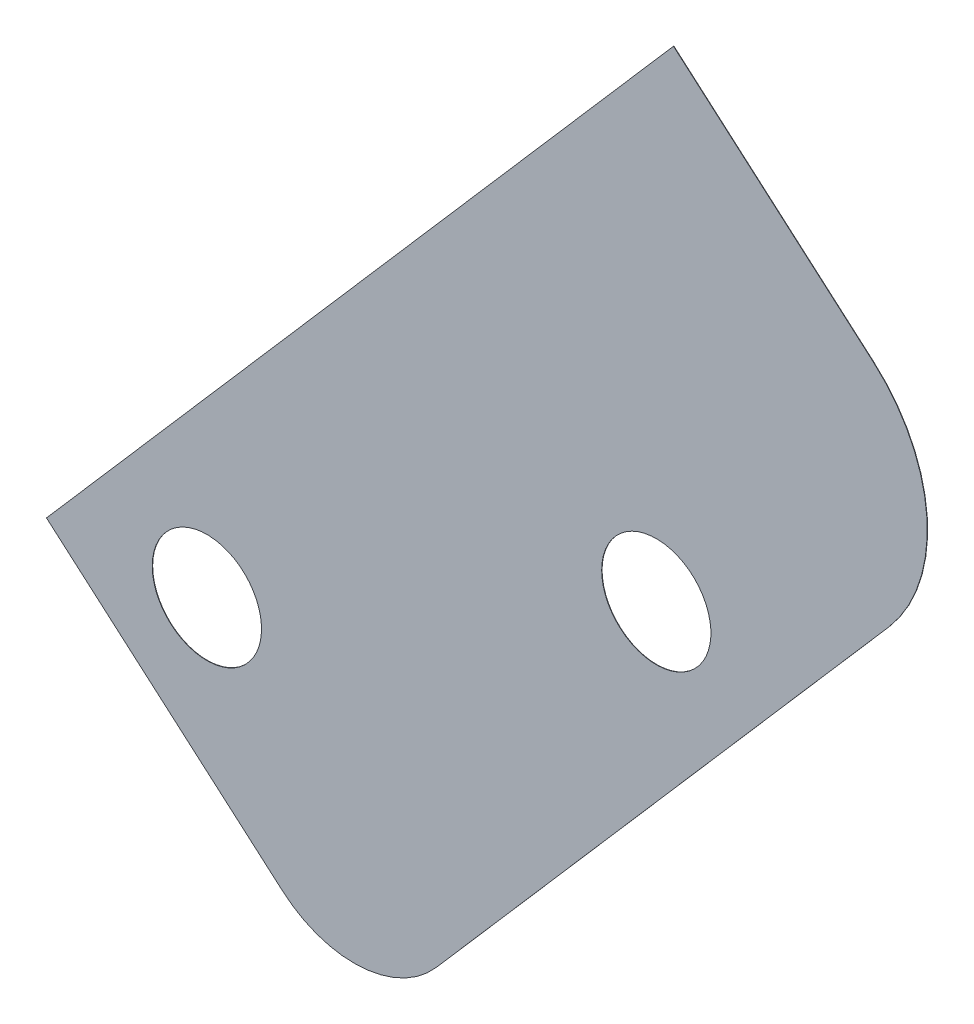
ISO-10303-21;
HEADER;
FILE_DESCRIPTION(('STEP AP214'),'2;1');
FILE_NAME('part.step','',(''),(''),'','','');
FILE_SCHEMA(('AUTOMOTIVE_DESIGN { 1 0 10303 214 1 1 1 1 }'));
ENDSEC;
DATA;
#1=APPLICATION_CONTEXT('core data for automotive mechanical design processes');
#2=APPLICATION_PROTOCOL_DEFINITION('international standard','automotive_design',2000,#1);
#3=PRODUCT_CONTEXT('',#1,'mechanical');
#4=PRODUCT('Part','Part','',(#3));
#5=PRODUCT_RELATED_PRODUCT_CATEGORY('part','',(#4));
#6=PRODUCT_DEFINITION_FORMATION('','',#4);
#7=PRODUCT_DEFINITION_CONTEXT('part definition',#1,'design');
#8=PRODUCT_DEFINITION('design','',#6,#7);
#9=PRODUCT_DEFINITION_SHAPE('','',#8);
#10=(LENGTH_UNIT() NAMED_UNIT(*) SI_UNIT(.MILLI.,.METRE.));
#11=(NAMED_UNIT(*) PLANE_ANGLE_UNIT() SI_UNIT($,.RADIAN.));
#12=(NAMED_UNIT(*) SI_UNIT($,.STERADIAN.) SOLID_ANGLE_UNIT());
#13=UNCERTAINTY_MEASURE_WITH_UNIT(LENGTH_MEASURE(1.E-05),#10,'distance_accuracy_value','');
#14=(GEOMETRIC_REPRESENTATION_CONTEXT(3) GLOBAL_UNCERTAINTY_ASSIGNED_CONTEXT((#13)) GLOBAL_UNIT_ASSIGNED_CONTEXT((#10,
#11,#12)) REPRESENTATION_CONTEXT('',''));
#15=CARTESIAN_POINT('',(0.,0.,0.));
#16=DIRECTION('',(0.,0.,1.));
#17=DIRECTION('',(1.,0.,0.));
#18=AXIS2_PLACEMENT_3D('',#15,#16,#17);
#19=CARTESIAN_POINT('',(-655.860193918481,-110.333995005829,0.0253999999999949));
#20=DIRECTION('',(0.,0.,-1.));
#21=DIRECTION('',(-1.,0.,0.));
#22=AXIS2_PLACEMENT_3D('',#19,#20,#21);
#23=CYLINDRICAL_SURFACE('',#22,7.11200000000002);
#24=CARTESIAN_POINT('',(-655.860193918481,-110.333995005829,0.));
#25=DIRECTION('',(0.,0.,1.));
#26=DIRECTION('',(1.,0.,0.));
#27=AXIS2_PLACEMENT_3D('',#24,#25,#26);
#28=CIRCLE('',#27,7.11200000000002);
#29=CARTESIAN_POINT('',(-660.52346212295,-115.703769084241,0.));
#30=VERTEX_POINT('',#29);
#31=CARTESIAN_POINT('',(-650.490419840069,-114.997263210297,0.));
#32=VERTEX_POINT('',#31);
#33=EDGE_CURVE('E135',#30,#32,#28,.T.);
#34=ORIENTED_EDGE('',*,*,#33,.T.);
#35=DIRECTION('',(0.,0.,-1.));
#36=VECTOR('',#35,1.);
#37=CARTESIAN_POINT('',(-650.490419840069,-114.997263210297,0.0253999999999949));
#38=LINE('',#37,#36);
#39=CARTESIAN_POINT('',(-650.490419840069,-114.997263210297,0.0253999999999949));
#40=VERTEX_POINT('',#39);
#41=EDGE_CURVE('E11',#40,#32,#38,.T.);
#42=ORIENTED_EDGE('',*,*,#41,.F.);
#43=CARTESIAN_POINT('',(-655.860193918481,-110.333995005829,0.0253999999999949));
#44=DIRECTION('',(0.,0.,1.));
#45=DIRECTION('',(1.,0.,0.));
#46=AXIS2_PLACEMENT_3D('',#43,#44,#45);
#47=CIRCLE('',#46,7.11200000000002);
#48=CARTESIAN_POINT('',(-660.52346212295,-115.703769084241,0.0253999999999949));
#49=VERTEX_POINT('',#48);
#50=EDGE_CURVE('E152',#49,#40,#47,.T.);
#51=ORIENTED_EDGE('',*,*,#50,.F.);
#52=DIRECTION('',(0.,0.,-1.));
#53=VECTOR('',#52,1.);
#54=CARTESIAN_POINT('',(-660.52346212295,-115.703769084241,0.0253999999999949));
#55=LINE('',#54,#53);
#56=EDGE_CURVE('E131',#49,#30,#55,.T.);
#57=ORIENTED_EDGE('',*,*,#56,.T.);
#58=EDGE_LOOP('',(#34,#42,#51,#57));
#59=FACE_BOUND('',#58,.T.);
#60=ADVANCED_FACE('F45',(#59),#23,.T.);
#61=CARTESIAN_POINT('',(-650.490419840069,-114.997263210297,0.0253999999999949));
#62=DIRECTION('',(-0.755030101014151,0.655690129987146,0.));
#63=DIRECTION('',(-0.655690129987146,-0.755030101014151,0.));
#64=AXIS2_PLACEMENT_3D('',#61,#62,#63);
#65=PLANE('',#64);
#66=DIRECTION('',(0.655690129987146,0.755030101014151,0.));
#67=VECTOR('',#66,1.);
#68=CARTESIAN_POINT('',(-650.490419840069,-114.997263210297,0.));
#69=LINE('',#68,#67);
#70=CARTESIAN_POINT('',(-620.928630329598,-80.9567311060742,0.));
#71=VERTEX_POINT('',#70);
#72=EDGE_CURVE('E139',#32,#71,#69,.T.);
#73=ORIENTED_EDGE('',*,*,#72,.T.);
#74=DIRECTION('',(0.,0.,-1.));
#75=VECTOR('',#74,1.);
#76=CARTESIAN_POINT('',(-620.928630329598,-80.9567311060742,0.0253999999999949));
#77=LINE('',#76,#75);
#78=CARTESIAN_POINT('',(-620.928630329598,-80.9567311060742,0.0253999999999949));
#79=VERTEX_POINT('',#78);
#80=EDGE_CURVE('E54',#79,#71,#77,.T.);
#81=ORIENTED_EDGE('',*,*,#80,.F.);
#82=DIRECTION('',(0.655690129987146,0.755030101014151,0.));
#83=VECTOR('',#82,1.);
#84=CARTESIAN_POINT('',(-650.490419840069,-114.997263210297,0.0253999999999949));
#85=LINE('',#84,#83);
#86=EDGE_CURVE('E99',#40,#79,#85,.T.);
#87=ORIENTED_EDGE('',*,*,#86,.F.);
#88=ORIENTED_EDGE('',*,*,#41,.T.);
#89=EDGE_LOOP('',(#73,#81,#87,#88));
#90=FACE_BOUND('',#89,.T.);
#91=ADVANCED_FACE('F182',(#90),#65,.F.);
#92=CARTESIAN_POINT('',(-628.695624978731,-74.2116467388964,0.0253999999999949));
#93=DIRECTION('',(0.,0.,-1.));
#94=DIRECTION('',(-1.,0.,0.));
#95=AXIS2_PLACEMENT_3D('',#92,#93,#94);
#96=CYLINDRICAL_SURFACE('',#95,10.287);
#97=CARTESIAN_POINT('',(-628.695624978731,-74.2116467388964,0.));
#98=DIRECTION('',(0.,0.,1.));
#99=DIRECTION('',(1.,0.,0.));
#100=AXIS2_PLACEMENT_3D('',#97,#98,#99);
#101=CIRCLE('',#100,10.287);
#102=CARTESIAN_POINT('',(-621.950540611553,-66.4446520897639,0.));
#103=VERTEX_POINT('',#102);
#104=EDGE_CURVE('E143',#71,#103,#101,.T.);
#105=ORIENTED_EDGE('',*,*,#104,.T.);
#106=DIRECTION('',(0.,0.,-1.));
#107=VECTOR('',#106,1.);
#108=CARTESIAN_POINT('',(-621.950540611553,-66.4446520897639,0.0253999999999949));
#109=LINE('',#108,#107);
#110=CARTESIAN_POINT('',(-621.950540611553,-66.4446520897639,0.0253999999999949));
#111=VERTEX_POINT('',#110);
#112=EDGE_CURVE('E123',#111,#103,#109,.T.);
#113=ORIENTED_EDGE('',*,*,#112,.F.);
#114=CARTESIAN_POINT('',(-628.695624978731,-74.2116467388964,0.0253999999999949));
#115=DIRECTION('',(0.,0.,1.));
#116=DIRECTION('',(1.,0.,0.));
#117=AXIS2_PLACEMENT_3D('',#114,#115,#116);
#118=CIRCLE('',#117,10.287);
#119=EDGE_CURVE('E112',#79,#111,#118,.T.);
#120=ORIENTED_EDGE('',*,*,#119,.F.);
#121=ORIENTED_EDGE('',*,*,#80,.T.);
#122=EDGE_LOOP('',(#105,#113,#120,#121));
#123=FACE_BOUND('',#122,.T.);
#124=ADVANCED_FACE('F163',(#123),#96,.T.);
#125=CARTESIAN_POINT('',(-621.950540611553,-66.4446520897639,0.0253999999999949));
#126=DIRECTION('',(-0.655690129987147,-0.75503010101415,0.));
#127=DIRECTION('',(0.75503010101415,-0.655690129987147,0.));
#128=AXIS2_PLACEMENT_3D('',#125,#126,#127);
#129=PLANE('',#128);
#130=DIRECTION('',(-0.75503010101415,0.655690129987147,0.));
#131=VECTOR('',#130,1.);
#132=CARTESIAN_POINT('',(-621.950540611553,-66.4446520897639,0.));
#133=LINE('',#132,#131);
#134=CARTESIAN_POINT('',(-634.991420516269,-55.1195721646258,0.));
#135=VERTEX_POINT('',#134);
#136=EDGE_CURVE('E121',#103,#135,#133,.T.);
#137=ORIENTED_EDGE('',*,*,#136,.T.);
#138=DIRECTION('',(0.,0.,-1.));
#139=VECTOR('',#138,1.);
#140=CARTESIAN_POINT('',(-634.991420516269,-55.1195721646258,0.0253999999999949));
#141=LINE('',#140,#139);
#142=CARTESIAN_POINT('',(-634.991420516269,-55.1195721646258,0.0253999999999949));
#143=VERTEX_POINT('',#142);
#144=EDGE_CURVE('E118',#143,#135,#141,.T.);
#145=ORIENTED_EDGE('',*,*,#144,.F.);
#146=DIRECTION('',(-0.75503010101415,0.655690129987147,0.));
#147=VECTOR('',#146,1.);
#148=CARTESIAN_POINT('',(-621.950540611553,-66.4446520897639,0.0253999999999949));
#149=LINE('',#148,#147);
#150=EDGE_CURVE('E106',#111,#143,#149,.T.);
#151=ORIENTED_EDGE('',*,*,#150,.F.);
#152=ORIENTED_EDGE('',*,*,#112,.T.);
#153=EDGE_LOOP('',(#137,#145,#151,#152));
#154=FACE_BOUND('',#153,.T.);
#155=ADVANCED_FACE('F119',(#154),#129,.F.);
#156=CARTESIAN_POINT('',(-634.991420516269,-55.1195721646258,0.0253999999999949));
#157=DIRECTION('',(0.755030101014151,-0.655690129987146,0.));
#158=DIRECTION('',(0.655690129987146,0.755030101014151,0.));
#159=AXIS2_PLACEMENT_3D('',#156,#157,#158);
#160=PLANE('',#159);
#161=DIRECTION('',(-0.655690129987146,-0.755030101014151,0.));
#162=VECTOR('',#161,1.);
#163=CARTESIAN_POINT('',(-634.991420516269,-55.1195721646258,0.));
#164=LINE('',#163,#162);
#165=CARTESIAN_POINT('',(-675.961562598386,-102.296872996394,0.));
#166=VERTEX_POINT('',#165);
#167=EDGE_CURVE('E85',#135,#166,#164,.T.);
#168=ORIENTED_EDGE('',*,*,#167,.T.);
#169=DIRECTION('',(0.,0.,-1.));
#170=VECTOR('',#169,1.);
#171=CARTESIAN_POINT('',(-675.961562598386,-102.296872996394,0.0253999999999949));
#172=LINE('',#171,#170);
#173=CARTESIAN_POINT('',(-675.961562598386,-102.296872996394,0.0253999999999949));
#174=VERTEX_POINT('',#173);
#175=EDGE_CURVE('E124',#174,#166,#172,.T.);
#176=ORIENTED_EDGE('',*,*,#175,.F.);
#177=DIRECTION('',(-0.655690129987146,-0.755030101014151,0.));
#178=VECTOR('',#177,1.);
#179=CARTESIAN_POINT('',(-634.991420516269,-55.1195721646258,0.0253999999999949));
#180=LINE('',#179,#178);
#181=EDGE_CURVE('E110',#143,#174,#180,.T.);
#182=ORIENTED_EDGE('',*,*,#181,.F.);
#183=ORIENTED_EDGE('',*,*,#144,.T.);
#184=EDGE_LOOP('',(#168,#176,#182,#183));
#185=FACE_BOUND('',#184,.T.);
#186=ADVANCED_FACE('F126',(#185),#160,.F.);
#187=CARTESIAN_POINT('',(-675.961562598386,-102.296872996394,0.0253999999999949));
#188=DIRECTION('',(0.655690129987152,0.755030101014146,0.));
#189=DIRECTION('',(-0.755030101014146,0.655690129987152,0.));
#190=AXIS2_PLACEMENT_3D('',#187,#188,#189);
#191=PLANE('',#190);
#192=DIRECTION('',(0.755030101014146,-0.655690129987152,0.));
#193=VECTOR('',#192,1.);
#194=CARTESIAN_POINT('',(-675.961562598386,-102.296872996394,0.));
#195=LINE('',#194,#193);
#196=EDGE_CURVE('E91',#166,#30,#195,.T.);
#197=ORIENTED_EDGE('',*,*,#196,.T.);
#198=ORIENTED_EDGE('',*,*,#56,.F.);
#199=DIRECTION('',(0.755030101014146,-0.655690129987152,0.));
#200=VECTOR('',#199,1.);
#201=CARTESIAN_POINT('',(-675.961562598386,-102.296872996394,0.0253999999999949));
#202=LINE('',#201,#200);
#203=EDGE_CURVE('E62',#174,#49,#202,.T.);
#204=ORIENTED_EDGE('',*,*,#203,.F.);
#205=ORIENTED_EDGE('',*,*,#175,.T.);
#206=EDGE_LOOP('',(#197,#198,#204,#205));
#207=FACE_BOUND('',#206,.T.);
#208=ADVANCED_FACE('F170',(#207),#191,.F.);
#209=CARTESIAN_POINT('',(-655.860193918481,-110.333995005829,0.0253999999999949));
#210=DIRECTION('',(0.,0.,1.));
#211=DIRECTION('',(1.,0.,0.));
#212=AXIS2_PLACEMENT_3D('',#209,#210,#211);
#213=PLANE('',#212);
#214=CARTESIAN_POINT('',(-665.480616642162,-101.558826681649,0.0253999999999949));
#215=DIRECTION('',(0.,0.,-1.));
#216=DIRECTION('',(-1.,0.,0.));
#217=AXIS2_PLACEMENT_3D('',#214,#215,#216);
#218=CIRCLE('',#217,3.56869999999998);
#219=CARTESIAN_POINT('',(-669.049316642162,-101.558826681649,0.0253999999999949));
#220=VERTEX_POINT('',#219);
#221=EDGE_CURVE('E250',#220,#220,#218,.T.);
#222=ORIENTED_EDGE('',*,*,#221,.T.);
#223=EDGE_LOOP('',(#222));
#224=FACE_BOUND('',#223,.T.);
#225=CARTESIAN_POINT('',(-636.114480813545,-87.1124959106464,0.0253999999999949));
#226=DIRECTION('',(0.,0.,-1.));
#227=DIRECTION('',(-1.,0.,0.));
#228=AXIS2_PLACEMENT_3D('',#225,#226,#227);
#229=CIRCLE('',#228,3.56869999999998);
#230=CARTESIAN_POINT('',(-639.683180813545,-87.1124959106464,0.0253999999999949));
#231=VERTEX_POINT('',#230);
#232=EDGE_CURVE('E255',#231,#231,#229,.T.);
#233=ORIENTED_EDGE('',*,*,#232,.T.);
#234=EDGE_LOOP('',(#233));
#235=FACE_BOUND('',#234,.T.);
#236=ORIENTED_EDGE('',*,*,#50,.T.);
#237=ORIENTED_EDGE('',*,*,#86,.T.);
#238=ORIENTED_EDGE('',*,*,#119,.T.);
#239=ORIENTED_EDGE('',*,*,#150,.T.);
#240=ORIENTED_EDGE('',*,*,#181,.T.);
#241=ORIENTED_EDGE('',*,*,#203,.T.);
#242=EDGE_LOOP('',(#236,#237,#238,#239,#240,#241));
#243=FACE_BOUND('',#242,.T.);
#244=ADVANCED_FACE('F108',(#224,#235,#243),#213,.T.);
#245=CARTESIAN_POINT('',(-655.860193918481,-110.333995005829,0.));
#246=DIRECTION('',(0.,0.,1.));
#247=DIRECTION('',(1.,0.,0.));
#248=AXIS2_PLACEMENT_3D('',#245,#246,#247);
#249=PLANE('',#248);
#250=CARTESIAN_POINT('',(-665.480616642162,-101.558826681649,0.));
#251=DIRECTION('',(0.,0.,-1.));
#252=DIRECTION('',(-1.,0.,0.));
#253=AXIS2_PLACEMENT_3D('',#250,#251,#252);
#254=CIRCLE('',#253,3.56869999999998);
#255=CARTESIAN_POINT('',(-669.049316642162,-101.558826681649,0.));
#256=VERTEX_POINT('',#255);
#257=EDGE_CURVE('E253',#256,#256,#254,.T.);
#258=ORIENTED_EDGE('',*,*,#257,.F.);
#259=EDGE_LOOP('',(#258));
#260=FACE_BOUND('',#259,.T.);
#261=CARTESIAN_POINT('',(-636.114480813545,-87.1124959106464,0.));
#262=DIRECTION('',(0.,0.,-1.));
#263=DIRECTION('',(-1.,0.,0.));
#264=AXIS2_PLACEMENT_3D('',#261,#262,#263);
#265=CIRCLE('',#264,3.56869999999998);
#266=CARTESIAN_POINT('',(-639.683180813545,-87.1124959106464,0.));
#267=VERTEX_POINT('',#266);
#268=EDGE_CURVE('E140',#267,#267,#265,.T.);
#269=ORIENTED_EDGE('',*,*,#268,.F.);
#270=EDGE_LOOP('',(#269));
#271=FACE_BOUND('',#270,.T.);
#272=ORIENTED_EDGE('',*,*,#33,.F.);
#273=ORIENTED_EDGE('',*,*,#196,.F.);
#274=ORIENTED_EDGE('',*,*,#167,.F.);
#275=ORIENTED_EDGE('',*,*,#136,.F.);
#276=ORIENTED_EDGE('',*,*,#104,.F.);
#277=ORIENTED_EDGE('',*,*,#72,.F.);
#278=EDGE_LOOP('',(#272,#273,#274,#275,#276,#277));
#279=FACE_BOUND('',#278,.T.);
#280=ADVANCED_FACE('F166',(#260,#271,#279),#249,.F.);
#281=CARTESIAN_POINT('',(-636.114480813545,-87.1124959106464,0.));
#282=DIRECTION('',(0.,0.,-1.));
#283=DIRECTION('',(-1.,0.,0.));
#284=AXIS2_PLACEMENT_3D('',#281,#282,#283);
#285=CYLINDRICAL_SURFACE('',#284,3.56869999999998);
#286=ORIENTED_EDGE('',*,*,#232,.F.);
#287=EDGE_LOOP('',(#286));
#288=FACE_BOUND('',#287,.T.);
#289=ORIENTED_EDGE('',*,*,#268,.T.);
#290=EDGE_LOOP('',(#289));
#291=FACE_BOUND('',#290,.T.);
#292=ADVANCED_FACE('F221',(#288,#291),#285,.F.);
#293=CARTESIAN_POINT('',(-665.480616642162,-101.558826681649,0.));
#294=DIRECTION('',(0.,0.,-1.));
#295=DIRECTION('',(-1.,0.,0.));
#296=AXIS2_PLACEMENT_3D('',#293,#294,#295);
#297=CYLINDRICAL_SURFACE('',#296,3.56869999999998);
#298=ORIENTED_EDGE('',*,*,#221,.F.);
#299=EDGE_LOOP('',(#298));
#300=FACE_BOUND('',#299,.T.);
#301=ORIENTED_EDGE('',*,*,#257,.T.);
#302=EDGE_LOOP('',(#301));
#303=FACE_BOUND('',#302,.T.);
#304=ADVANCED_FACE('F231',(#300,#303),#297,.F.);
#305=CLOSED_SHELL('',(#60,#91,#124,#155,#186,#208,#244,#280,#292,#304));
#306=MANIFOLD_SOLID_BREP('B2',#305);
#307=ADVANCED_BREP_SHAPE_REPRESENTATION('',(#18,#306),#14);
#308=SHAPE_DEFINITION_REPRESENTATION(#9,#307);
ENDSEC;
END-ISO-10303-21;
